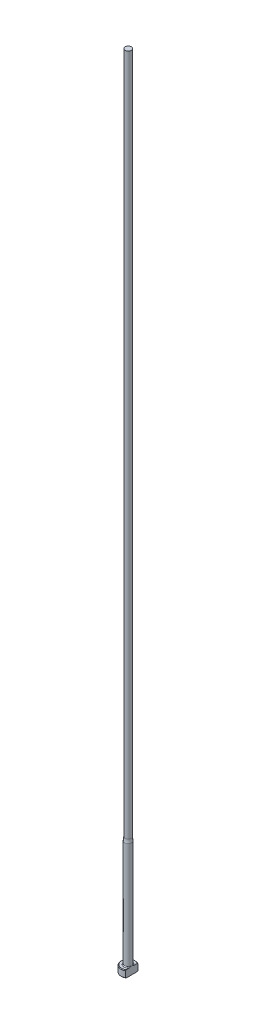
ISO-10303-21;
HEADER;
FILE_DESCRIPTION(('STEP AP214'),'2;1');
FILE_NAME('part.step','',(''),(''),'','','');
FILE_SCHEMA(('AUTOMOTIVE_DESIGN { 1 0 10303 214 1 1 1 1 }'));
ENDSEC;
DATA;
#1=APPLICATION_CONTEXT('core data for automotive mechanical design processes');
#2=APPLICATION_PROTOCOL_DEFINITION('international standard','automotive_design',2000,#1);
#3=PRODUCT_CONTEXT('',#1,'mechanical');
#4=PRODUCT('Part','Part','',(#3));
#5=PRODUCT_RELATED_PRODUCT_CATEGORY('part','',(#4));
#6=PRODUCT_DEFINITION_FORMATION('','',#4);
#7=PRODUCT_DEFINITION_CONTEXT('part definition',#1,'design');
#8=PRODUCT_DEFINITION('design','',#6,#7);
#9=PRODUCT_DEFINITION_SHAPE('','',#8);
#10=(LENGTH_UNIT() NAMED_UNIT(*) SI_UNIT(.MILLI.,.METRE.));
#11=(NAMED_UNIT(*) PLANE_ANGLE_UNIT() SI_UNIT($,.RADIAN.));
#12=(NAMED_UNIT(*) SI_UNIT($,.STERADIAN.) SOLID_ANGLE_UNIT());
#13=UNCERTAINTY_MEASURE_WITH_UNIT(LENGTH_MEASURE(1.E-05),#10,'distance_accuracy_value','');
#14=(GEOMETRIC_REPRESENTATION_CONTEXT(3) GLOBAL_UNCERTAINTY_ASSIGNED_CONTEXT((#13)) GLOBAL_UNIT_ASSIGNED_CONTEXT((#10,
#11,#12)) REPRESENTATION_CONTEXT('',''));
#15=CARTESIAN_POINT('',(0.,0.,0.));
#16=DIRECTION('',(0.,0.,1.));
#17=DIRECTION('',(1.,0.,0.));
#18=AXIS2_PLACEMENT_3D('',#15,#16,#17);
#19=CARTESIAN_POINT('',(-3.17499999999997,3.175,0.));
#20=DIRECTION('',(0.,1.,0.));
#21=DIRECTION('',(0.,0.,1.));
#22=AXIS2_PLACEMENT_3D('',#19,#20,#21);
#23=PLANE('',#22);
#24=CARTESIAN_POINT('',(0.,3.175,0.));
#25=DIRECTION('',(0.,1.,0.));
#26=DIRECTION('',(0.,0.,1.));
#27=AXIS2_PLACEMENT_3D('',#24,#25,#26);
#28=CIRCLE('',#27,2.92099999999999);
#29=CARTESIAN_POINT('',(1.58749999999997,3.175,-2.4519552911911));
#30=VERTEX_POINT('',#29);
#31=CARTESIAN_POINT('',(1.58749999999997,3.175,2.4519552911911));
#32=VERTEX_POINT('',#31);
#33=EDGE_CURVE('E105',#30,#32,#28,.T.);
#34=ORIENTED_EDGE('',*,*,#33,.T.);
#35=DIRECTION('',(0.,0.,1.));
#36=VECTOR('',#35,1.);
#37=CARTESIAN_POINT('',(1.58749999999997,3.17499999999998,2.74963065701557));
#38=LINE('',#37,#36);
#39=CARTESIAN_POINT('',(1.58749999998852,3.175,1.16397422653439));
#40=VERTEX_POINT('',#39);
#41=EDGE_CURVE('E126',#40,#32,#38,.T.);
#42=ORIENTED_EDGE('',*,*,#41,.F.);
#43=CARTESIAN_POINT('',(0.,3.175,0.));
#44=DIRECTION('',(0.,1.,0.));
#45=DIRECTION('',(0.,0.,1.));
#46=AXIS2_PLACEMENT_3D('',#43,#44,#45);
#47=CIRCLE('',#46,1.96849999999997);
#48=CARTESIAN_POINT('',(1.58749999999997,3.175,-1.16397422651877));
#49=VERTEX_POINT('',#48);
#50=EDGE_CURVE('E11',#40,#49,#47,.F.);
#51=ORIENTED_EDGE('',*,*,#50,.T.);
#52=EDGE_CURVE('E52',#30,#49,#38,.T.);
#53=ORIENTED_EDGE('',*,*,#52,.F.);
#54=EDGE_LOOP('',(#34,#42,#51,#53));
#55=FACE_BOUND('',#54,.T.);
#56=ADVANCED_FACE('F32',(#55),#23,.T.);
#57=CARTESIAN_POINT('',(0.,259.958771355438,0.));
#58=DIRECTION('',(0.,1.,0.));
#59=DIRECTION('',(0.,0.,1.));
#60=AXIS2_PLACEMENT_3D('',#57,#58,#59);
#61=CYLINDRICAL_SURFACE('',#60,3.17499999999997);
#62=CARTESIAN_POINT('',(0.,2.92100000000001,0.));
#63=DIRECTION('',(0.,1.,0.));
#64=DIRECTION('',(0.,0.,1.));
#65=AXIS2_PLACEMENT_3D('',#62,#63,#64);
#66=CIRCLE('',#65,3.17499999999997);
#67=CARTESIAN_POINT('',(1.58749999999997,2.92100000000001,2.74963065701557));
#68=VERTEX_POINT('',#67);
#69=CARTESIAN_POINT('',(1.58749999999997,2.92100000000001,-2.74963065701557));
#70=VERTEX_POINT('',#69);
#71=EDGE_CURVE('E98',#68,#70,#66,.F.);
#72=ORIENTED_EDGE('',*,*,#71,.T.);
#73=DIRECTION('',(0.,-1.,0.));
#74=VECTOR('',#73,1.);
#75=CARTESIAN_POINT('',(1.58749999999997,355.601,-2.74963065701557));
#76=LINE('',#75,#74);
#77=CARTESIAN_POINT('',(1.58749999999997,0.253999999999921,-2.74963065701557));
#78=VERTEX_POINT('',#77);
#79=EDGE_CURVE('E141',#70,#78,#76,.T.);
#80=ORIENTED_EDGE('',*,*,#79,.T.);
#81=CARTESIAN_POINT('',(0.,0.253999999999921,0.));
#82=DIRECTION('',(0.,-1.,0.));
#83=DIRECTION('',(0.,0.,-1.));
#84=AXIS2_PLACEMENT_3D('',#81,#82,#83);
#85=CIRCLE('',#84,3.17499999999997);
#86=CARTESIAN_POINT('',(1.58749999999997,0.253999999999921,2.74963065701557));
#87=VERTEX_POINT('',#86);
#88=EDGE_CURVE('E95',#78,#87,#85,.F.);
#89=ORIENTED_EDGE('',*,*,#88,.T.);
#90=DIRECTION('',(0.,-1.,0.));
#91=VECTOR('',#90,1.);
#92=CARTESIAN_POINT('',(1.58749999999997,355.601,2.74963065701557));
#93=LINE('',#92,#91);
#94=EDGE_CURVE('E88',#68,#87,#93,.T.);
#95=ORIENTED_EDGE('',*,*,#94,.F.);
#96=EDGE_LOOP('',(#72,#80,#89,#95));
#97=FACE_BOUND('',#96,.T.);
#98=ADVANCED_FACE('F191',(#97),#61,.T.);
#99=CARTESIAN_POINT('',(0.,0.,0.));
#100=DIRECTION('',(0.,-1.,0.));
#101=DIRECTION('',(0.,0.,-1.));
#102=AXIS2_PLACEMENT_3D('',#99,#100,#101);
#103=PLANE('',#102);
#104=CARTESIAN_POINT('',(0.,0.,0.));
#105=DIRECTION('',(0.,-1.,0.));
#106=DIRECTION('',(0.,0.,-1.));
#107=AXIS2_PLACEMENT_3D('',#104,#105,#106);
#108=CIRCLE('',#107,2.92100000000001);
#109=CARTESIAN_POINT('',(1.58749999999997,0.,2.45195529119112));
#110=VERTEX_POINT('',#109);
#111=CARTESIAN_POINT('',(1.58749999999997,0.,-2.45195529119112));
#112=VERTEX_POINT('',#111);
#113=EDGE_CURVE('E93',#110,#112,#108,.T.);
#114=ORIENTED_EDGE('',*,*,#113,.T.);
#115=DIRECTION('',(0.,0.,1.));
#116=VECTOR('',#115,1.);
#117=CARTESIAN_POINT('',(1.58749999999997,0.,2.74963065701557));
#118=LINE('',#117,#116);
#119=EDGE_CURVE('E78',#112,#110,#118,.T.);
#120=ORIENTED_EDGE('',*,*,#119,.T.);
#121=EDGE_LOOP('',(#114,#120));
#122=FACE_BOUND('',#121,.T.);
#123=ADVANCED_FACE('F97',(#122),#103,.T.);
#124=CARTESIAN_POINT('',(0.,3.17499999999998,0.));
#125=DIRECTION('',(0.,-1.,0.));
#126=DIRECTION('',(0.,0.,-1.));
#127=AXIS2_PLACEMENT_3D('',#124,#125,#126);
#128=CONICAL_SURFACE('',#127,2.92100000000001,0.785398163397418);
#129=ORIENTED_EDGE('',*,*,#71,.F.);
#130=CARTESIAN_POINT('',(1.58749999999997,-0.161620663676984,-6.0529050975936));
#131=CARTESIAN_POINT('',(1.58749999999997,-0.0288893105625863,-5.91567682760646));
#132=CARTESIAN_POINT('',(1.58749999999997,0.103699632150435,-5.77831035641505));
#133=CARTESIAN_POINT('',(1.58749999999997,0.368508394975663,-5.50321874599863));
#134=CARTESIAN_POINT('',(1.58749999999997,0.5007282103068,-5.3654936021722));
#135=CARTESIAN_POINT('',(1.58749999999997,0.764778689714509,-5.08953516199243));
#136=CARTESIAN_POINT('',(1.58749999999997,0.896609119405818,-4.95130164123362));
#137=CARTESIAN_POINT('',(1.58749999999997,1.15968706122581,-4.67428233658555));
#138=CARTESIAN_POINT('',(1.58749999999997,1.29093457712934,-4.5354965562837));
#139=CARTESIAN_POINT('',(1.58749999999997,1.55007705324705,-4.25997724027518));
#140=CARTESIAN_POINT('',(1.58749999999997,1.67798684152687,-4.12325766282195));
#141=CARTESIAN_POINT('',(1.58749999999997,1.9328486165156,-3.84892898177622));
#142=CARTESIAN_POINT('',(1.58749999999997,2.05980060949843,-3.71131988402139));
#143=CARTESIAN_POINT('',(1.58749999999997,2.31237508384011,-3.43493978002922));
#144=CARTESIAN_POINT('',(1.58749999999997,2.43799784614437,-3.29616903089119));
#145=CARTESIAN_POINT('',(1.58749999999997,2.68741369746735,-3.01699558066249));
#146=CARTESIAN_POINT('',(1.58749999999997,2.81120686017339,-2.8765929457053));
#147=CARTESIAN_POINT('',(1.58749999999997,3.00875865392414,-2.64816703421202));
#148=CARTESIAN_POINT('',(1.58749999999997,3.08336151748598,-2.56087478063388));
#149=CARTESIAN_POINT('',(1.58749999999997,3.23123871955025,-2.385154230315));
#150=CARTESIAN_POINT('',(1.58749999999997,3.30451292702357,-2.29672582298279));
#151=CARTESIAN_POINT('',(1.58749999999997,3.45004422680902,-2.11747400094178));
#152=CARTESIAN_POINT('',(1.58749999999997,3.52228237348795,-2.02663514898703));
#153=CARTESIAN_POINT('',(1.58749999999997,3.66423097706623,-1.84302524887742));
#154=CARTESIAN_POINT('',(1.58749999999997,3.73394203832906,-1.75025467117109));
#155=CARTESIAN_POINT('',(1.58749999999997,3.87080633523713,-1.56067475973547));
#156=CARTESIAN_POINT('',(1.58749999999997,3.93790459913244,-1.46382547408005));
#157=CARTESIAN_POINT('',(1.58749999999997,4.06669147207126,-1.26632594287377));
#158=CARTESIAN_POINT('',(1.58749999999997,4.12837264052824,-1.16567073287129));
#159=CARTESIAN_POINT('',(1.58749999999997,4.21402252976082,-1.01165766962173));
#160=CARTESIAN_POINT('',(1.58749999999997,4.2412792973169,-0.960142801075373));
#161=CARTESIAN_POINT('',(1.58749999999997,4.29309798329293,-0.85578092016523));
#162=CARTESIAN_POINT('',(1.58749999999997,4.3176594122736,-0.802933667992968));
#163=CARTESIAN_POINT('',(1.58749999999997,4.38614656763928,-0.642461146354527));
#164=CARTESIAN_POINT('',(1.58749999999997,4.42510149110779,-0.532518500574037));
#165=CARTESIAN_POINT('',(1.58749999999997,4.46726244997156,-0.367680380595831));
#166=CARTESIAN_POINT('',(1.58749999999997,4.47844427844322,-0.314802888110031));
#167=CARTESIAN_POINT('',(1.58749999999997,4.49576654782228,-0.208209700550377));
#168=CARTESIAN_POINT('',(1.58749999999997,4.50190743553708,-0.154494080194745));
#169=CARTESIAN_POINT('',(1.58749999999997,4.50871296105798,-0.0468792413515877));
#170=CARTESIAN_POINT('',(1.58749999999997,4.50939451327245,0.00701889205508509));
#171=CARTESIAN_POINT('',(1.58749999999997,4.5052767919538,0.114606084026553));
#172=CARTESIAN_POINT('',(1.58749999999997,4.5004770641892,0.16829512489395));
#173=CARTESIAN_POINT('',(1.58749999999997,4.48579689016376,0.274485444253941));
#174=CARTESIAN_POINT('',(1.58749999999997,4.47596081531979,0.326992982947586));
#175=CARTESIAN_POINT('',(1.58749999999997,4.4518180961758,0.430974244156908));
#176=CARTESIAN_POINT('',(1.58749999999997,4.43750969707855,0.482447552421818));
#177=CARTESIAN_POINT('',(1.58749999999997,4.40502489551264,0.58446088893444));
#178=CARTESIAN_POINT('',(1.58749999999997,4.38682724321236,0.634994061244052));
#179=CARTESIAN_POINT('',(1.58749999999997,4.34729308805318,0.734789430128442));
#180=CARTESIAN_POINT('',(1.58749999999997,4.32595722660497,0.784051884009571));
#181=CARTESIAN_POINT('',(1.58749999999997,4.25791922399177,0.93054934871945));
#182=CARTESIAN_POINT('',(1.58749999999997,4.20736047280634,1.02598802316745));
#183=CARTESIAN_POINT('',(1.58749999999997,4.09955451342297,1.21304313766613));
#184=CARTESIAN_POINT('',(1.58749999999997,4.04229912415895,1.30465471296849));
#185=CARTESIAN_POINT('',(1.58749999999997,3.92308746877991,1.48526211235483));
#186=CARTESIAN_POINT('',(1.58749999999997,3.86111349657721,1.57424615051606));
#187=CARTESIAN_POINT('',(1.58749999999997,3.73408621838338,1.74990003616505));
#188=CARTESIAN_POINT('',(1.58749999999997,3.66903444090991,1.83657099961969));
#189=CARTESIAN_POINT('',(1.58749999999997,3.53583371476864,2.009317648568));
#190=CARTESIAN_POINT('',(1.58749999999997,3.46765527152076,2.09537048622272));
#191=CARTESIAN_POINT('',(1.58749999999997,3.32960643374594,2.26611736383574));
#192=CARTESIAN_POINT('',(1.58749999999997,3.25973586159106,2.35081125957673));
#193=CARTESIAN_POINT('',(1.58749999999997,3.04858139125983,2.60290121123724));
#194=CARTESIAN_POINT('',(1.58749999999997,2.90542388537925,2.7687253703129));
#195=CARTESIAN_POINT('',(1.58749999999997,2.64069522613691,3.06970913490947));
#196=CARTESIAN_POINT('',(1.58749999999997,2.5195945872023,3.20528660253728));
#197=CARTESIAN_POINT('',(1.58749999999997,2.27590400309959,3.47510321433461));
#198=CARTESIAN_POINT('',(1.58749999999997,2.1533140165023,3.60934232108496));
#199=CARTESIAN_POINT('',(1.58749999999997,1.9069423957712,3.87695374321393));
#200=CARTESIAN_POINT('',(1.58749999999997,1.78315974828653,4.01032512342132));
#201=CARTESIAN_POINT('',(1.58749999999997,1.53478104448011,4.2763088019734));
#202=CARTESIAN_POINT('',(1.58749999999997,1.41018498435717,4.40892109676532));
#203=CARTESIAN_POINT('',(1.58749999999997,1.04574684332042,4.79499418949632));
#204=CARTESIAN_POINT('',(1.58749999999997,0.805076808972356,5.04767313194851));
#205=CARTESIAN_POINT('',(1.58749999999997,0.44312150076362,5.42550911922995));
#206=CARTESIAN_POINT('',(1.58749999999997,0.322378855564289,5.55118772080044));
#207=CARTESIAN_POINT('',(1.58749999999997,0.0805914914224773,5.8022520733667));
#208=CARTESIAN_POINT('',(1.58749999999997,-0.0404532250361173,5.92763782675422));
#209=CARTESIAN_POINT('',(1.58749999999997,-0.161620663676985,6.0529050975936));
#210=B_SPLINE_CURVE_WITH_KNOTS('',3,(#130,#131,#132,#133,#134,#135,#136,#137,#138,#139,#140,
#141,#142,#143,#144,#145,#146,#147,#148,#149,#150,#151,#152,#153,#154,#155,#156,#157,#158,#159,
#160,#161,#162,#163,#164,#165,#166,#167,#168,#169,#170,#171,#172,#173,#174,#175,#176,#177,#178,
#179,#180,#181,#182,#183,#184,#185,#186,#187,#188,#189,#190,#191,#192,#193,#194,#195,#196,#197,
#198,#199,#200,#201,#202,#203,#204,#205,#206,#207,#208,#209),.UNSPECIFIED.,.F.,.F.,(4,2,2,2,2,2,
2,2,2,2,2,2,2,2,2,2,2,2,2,2,2,2,2,2,2,2,2,2,2,2,2,2,2,2,2,2,2,2,2,4),(0.,0.572750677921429,
1.14550874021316,1.71856057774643,2.29160869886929,2.85328006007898,3.41494773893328,
3.97649423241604,4.53801804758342,4.88249307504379,5.2270018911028,5.57515326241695,
5.92322081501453,6.27657800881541,6.63041319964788,6.80518126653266,6.97998101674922,
7.32824262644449,7.49018491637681,7.65211285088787,7.81353889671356,7.97497832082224,
8.13501929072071,8.29512313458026,8.45612518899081,8.61709438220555,8.94062993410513,
9.26456495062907,9.58978187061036,9.91483894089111,10.2441741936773,10.5735441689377,
11.2306812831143,11.7760337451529,12.3214014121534,12.8672825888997,13.4131663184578,
14.4600164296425,14.9828595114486,15.505698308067),.UNSPECIFIED.);
#211=EDGE_CURVE('E118',#32,#68,#210,.T.);
#212=ORIENTED_EDGE('',*,*,#211,.F.);
#213=ORIENTED_EDGE('',*,*,#33,.F.);
#214=EDGE_CURVE('E117',#70,#30,#210,.T.);
#215=ORIENTED_EDGE('',*,*,#214,.F.);
#216=EDGE_LOOP('',(#129,#212,#213,#215));
#217=FACE_BOUND('',#216,.T.);
#218=ADVANCED_FACE('F162',(#217),#128,.T.);
#219=CARTESIAN_POINT('',(0.,0.253999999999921,0.));
#220=DIRECTION('',(0.,1.,0.));
#221=DIRECTION('',(0.,0.,1.));
#222=AXIS2_PLACEMENT_3D('',#219,#220,#221);
#223=CONICAL_SURFACE('',#222,3.17499999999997,0.785398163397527);
#224=ORIENTED_EDGE('',*,*,#88,.F.);
#225=CARTESIAN_POINT('',(1.58749999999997,3.33662066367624,6.0529050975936));
#226=CARTESIAN_POINT('',(1.58749999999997,3.20388931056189,5.91567682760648));
#227=CARTESIAN_POINT('',(1.58749999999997,3.07130036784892,5.7783103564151));
#228=CARTESIAN_POINT('',(1.58749999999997,2.80649160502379,5.50321874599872));
#229=CARTESIAN_POINT('',(1.58749999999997,2.6742717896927,5.36549360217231));
#230=CARTESIAN_POINT('',(1.58749999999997,2.41022131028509,5.08953516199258));
#231=CARTESIAN_POINT('',(1.58749999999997,2.27839088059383,4.95130164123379));
#232=CARTESIAN_POINT('',(1.58749999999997,2.01531293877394,4.67428233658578));
#233=CARTESIAN_POINT('',(1.58749999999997,1.88406542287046,4.53549655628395));
#234=CARTESIAN_POINT('',(1.58749999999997,1.62492294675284,4.25997724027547));
#235=CARTESIAN_POINT('',(1.58749999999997,1.49701315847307,4.12325766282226));
#236=CARTESIAN_POINT('',(1.58749999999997,1.24215138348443,3.84892898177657));
#237=CARTESIAN_POINT('',(1.58749999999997,1.11519939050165,3.71131988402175));
#238=CARTESIAN_POINT('',(1.58749999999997,0.862624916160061,3.43493978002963));
#239=CARTESIAN_POINT('',(1.58749999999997,0.737002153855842,3.29616903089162));
#240=CARTESIAN_POINT('',(1.58749999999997,0.487586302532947,3.01699558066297));
#241=CARTESIAN_POINT('',(1.58749999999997,0.363793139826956,2.8765929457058));
#242=CARTESIAN_POINT('',(1.58749999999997,0.166241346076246,2.64816703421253));
#243=CARTESIAN_POINT('',(1.58749999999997,0.0916384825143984,2.56087478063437));
#244=CARTESIAN_POINT('',(1.58749999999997,-0.0562387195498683,2.38515423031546));
#245=CARTESIAN_POINT('',(1.58749999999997,-0.129512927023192,2.29672582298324));
#246=CARTESIAN_POINT('',(1.58749999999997,-0.275044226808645,2.1174740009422));
#247=CARTESIAN_POINT('',(1.58749999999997,-0.347282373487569,2.02663514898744));
#248=CARTESIAN_POINT('',(1.58749999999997,-0.489230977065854,1.8430252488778));
#249=CARTESIAN_POINT('',(1.58749999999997,-0.558942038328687,1.75025467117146));
#250=CARTESIAN_POINT('',(1.58749999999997,-0.695806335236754,1.5606747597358));
#251=CARTESIAN_POINT('',(1.58749999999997,-0.762904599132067,1.46382547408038));
#252=CARTESIAN_POINT('',(1.58749999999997,-0.89169147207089,1.26632594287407));
#253=CARTESIAN_POINT('',(1.58749999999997,-0.953372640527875,1.16567073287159));
#254=CARTESIAN_POINT('',(1.58749999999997,-1.03902252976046,1.01165766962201));
#255=CARTESIAN_POINT('',(1.58749999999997,-1.06627929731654,0.960142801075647));
#256=CARTESIAN_POINT('',(1.58749999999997,-1.11809798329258,0.855780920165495));
#257=CARTESIAN_POINT('',(1.58749999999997,-1.14265941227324,0.802933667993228));
#258=CARTESIAN_POINT('',(1.58749999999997,-1.21114656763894,0.642461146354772));
#259=CARTESIAN_POINT('',(1.58749999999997,-1.25010149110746,0.532518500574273));
#260=CARTESIAN_POINT('',(1.58749999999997,-1.29226244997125,0.367680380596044));
#261=CARTESIAN_POINT('',(1.58749999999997,-1.30344427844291,0.314802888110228));
#262=CARTESIAN_POINT('',(1.58749999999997,-1.32076654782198,0.208209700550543));
#263=CARTESIAN_POINT('',(1.58749999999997,-1.32690743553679,0.154494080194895));
#264=CARTESIAN_POINT('',(1.58749999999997,-1.3337129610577,0.0468792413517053));
#265=CARTESIAN_POINT('',(1.58749999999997,-1.33439451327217,-0.00701889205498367));
#266=CARTESIAN_POINT('',(1.58749999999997,-1.33027679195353,-0.114606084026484));
#267=CARTESIAN_POINT('',(1.58749999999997,-1.32547706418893,-0.168295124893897));
#268=CARTESIAN_POINT('',(1.58749999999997,-1.31079689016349,-0.274485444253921));
#269=CARTESIAN_POINT('',(1.58749999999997,-1.30096081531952,-0.326992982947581));
#270=CARTESIAN_POINT('',(1.58749999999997,-1.27681809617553,-0.430974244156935));
#271=CARTESIAN_POINT('',(1.58749999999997,-1.26250969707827,-0.48244755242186));
#272=CARTESIAN_POINT('',(1.58749999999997,-1.23002489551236,-0.584460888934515));
#273=CARTESIAN_POINT('',(1.58749999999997,-1.21182724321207,-0.634994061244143));
#274=CARTESIAN_POINT('',(1.58749999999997,-1.17229308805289,-0.734789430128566));
#275=CARTESIAN_POINT('',(1.58749999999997,-1.15095722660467,-0.784051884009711));
#276=CARTESIAN_POINT('',(1.58749999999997,-1.08291922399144,-0.930549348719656));
#277=CARTESIAN_POINT('',(1.58749999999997,-1.03236047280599,-1.0259880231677));
#278=CARTESIAN_POINT('',(1.58749999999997,-0.924554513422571,-1.21304313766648));
#279=CARTESIAN_POINT('',(1.58749999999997,-0.867299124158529,-1.30465471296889));
#280=CARTESIAN_POINT('',(1.58749999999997,-0.748087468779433,-1.48526211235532));
#281=CARTESIAN_POINT('',(1.58749999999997,-0.686113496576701,-1.5742461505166));
#282=CARTESIAN_POINT('',(1.58749999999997,-0.559086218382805,-1.74990003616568));
#283=CARTESIAN_POINT('',(1.58749999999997,-0.494034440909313,-1.83657099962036));
#284=CARTESIAN_POINT('',(1.58749999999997,-0.360833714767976,-2.00931764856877));
#285=CARTESIAN_POINT('',(1.58749999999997,-0.292655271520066,-2.09537048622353));
#286=CARTESIAN_POINT('',(1.58749999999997,-0.154606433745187,-2.26611736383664));
#287=CARTESIAN_POINT('',(1.58749999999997,-0.0847358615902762,-2.35081125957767));
#288=CARTESIAN_POINT('',(1.58749999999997,0.126418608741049,-2.60290121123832));
#289=CARTESIAN_POINT('',(1.58749999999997,0.269576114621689,-2.76872537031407));
#290=CARTESIAN_POINT('',(1.58749999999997,0.534304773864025,-3.06970913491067));
#291=CARTESIAN_POINT('',(1.58749999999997,0.655405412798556,-3.20528660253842));
#292=CARTESIAN_POINT('',(1.58749999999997,0.899095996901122,-3.47510321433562));
#293=CARTESIAN_POINT('',(1.58749999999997,1.02168598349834,-3.60934232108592));
#294=CARTESIAN_POINT('',(1.58749999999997,1.26805760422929,-3.87695374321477));
#295=CARTESIAN_POINT('',(1.58749999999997,1.39184025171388,-4.0103251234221));
#296=CARTESIAN_POINT('',(1.58749999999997,1.64021895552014,-4.27630880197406));
#297=CARTESIAN_POINT('',(1.58749999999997,1.76481501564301,-4.40892109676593));
#298=CARTESIAN_POINT('',(1.58749999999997,2.12925315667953,-4.79499418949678));
#299=CARTESIAN_POINT('',(1.58749999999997,2.36992319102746,-5.04767313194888));
#300=CARTESIAN_POINT('',(1.58749999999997,2.73187849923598,-5.42550911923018));
#301=CARTESIAN_POINT('',(1.58749999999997,2.85262114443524,-5.55118772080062));
#302=CARTESIAN_POINT('',(1.58749999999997,3.09440850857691,-5.80225207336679));
#303=CARTESIAN_POINT('',(1.58749999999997,3.21545322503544,-5.92763782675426));
#304=CARTESIAN_POINT('',(1.58749999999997,3.33662066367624,-6.0529050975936));
#305=B_SPLINE_CURVE_WITH_KNOTS('',3,(#225,#226,#227,#228,#229,#230,#231,#232,#233,#234,#235,
#236,#237,#238,#239,#240,#241,#242,#243,#244,#245,#246,#247,#248,#249,#250,#251,#252,#253,#254,
#255,#256,#257,#258,#259,#260,#261,#262,#263,#264,#265,#266,#267,#268,#269,#270,#271,#272,#273,
#274,#275,#276,#277,#278,#279,#280,#281,#282,#283,#284,#285,#286,#287,#288,#289,#290,#291,#292,
#293,#294,#295,#296,#297,#298,#299,#300,#301,#302,#303,#304),.UNSPECIFIED.,.F.,.F.,(4,2,2,2,2,2,
2,2,2,2,2,2,2,2,2,2,2,2,2,2,2,2,2,2,2,2,2,2,2,2,2,2,2,2,2,2,2,2,2,4),(0.,0.572750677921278,
1.14550874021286,1.71856057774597,2.29160869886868,2.85328006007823,3.4149477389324,
3.97649423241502,4.53801804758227,4.88249307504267,5.22700189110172,5.5751532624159,
5.92322081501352,6.27657800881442,6.63041319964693,6.80518126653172,6.9799810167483,
7.3282426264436,7.49018491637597,7.65211285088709,7.81353889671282,7.97497832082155,
8.13501929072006,8.29512313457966,8.45612518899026,8.61709438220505,8.9406299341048,
9.2645649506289,9.58978187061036,9.91483894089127,10.2441741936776,10.5735441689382,
11.2306812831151,11.7760337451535,12.3214014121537,12.8672825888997,13.4131663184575,
14.4600164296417,14.9828595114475,15.5056983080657),.UNSPECIFIED.);
#306=EDGE_CURVE('E81',#112,#78,#305,.T.);
#307=ORIENTED_EDGE('',*,*,#306,.F.);
#308=ORIENTED_EDGE('',*,*,#113,.F.);
#309=EDGE_CURVE('E84',#87,#110,#305,.T.);
#310=ORIENTED_EDGE('',*,*,#309,.F.);
#311=EDGE_LOOP('',(#224,#307,#308,#310));
#312=FACE_BOUND('',#311,.T.);
#313=ADVANCED_FACE('F92',(#312),#223,.T.);
#314=CARTESIAN_POINT('',(0.,3.556,0.));
#315=DIRECTION('',(0.,1.,0.));
#316=DIRECTION('',(0.,0.,1.));
#317=AXIS2_PLACEMENT_3D('',#314,#315,#316);
#318=TOROIDAL_SURFACE('',#317,1.96849999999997,0.381);
#319=CARTESIAN_POINT('',(1.58749999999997,3.556,0.));
#320=CARTESIAN_POINT('',(1.58749999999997,3.55599928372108,-9.72839998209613E-12));
#321=CARTESIAN_POINT('',(1.58749999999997,3.55599856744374,-1.16390048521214E-07));
#322=CARTESIAN_POINT('',(1.58749999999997,3.55599717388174,-5.02802253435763E-07));
#323=CARTESIAN_POINT('',(1.58749999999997,3.55599649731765,-7.75049116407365E-07));
#324=CARTESIAN_POINT('',(1.58749999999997,3.55599515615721,-1.43578185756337E-06));
#325=CARTESIAN_POINT('',(1.58749999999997,3.55599449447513,-1.83004116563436E-06));
#326=CARTESIAN_POINT('',(1.58749999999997,3.55599322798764,-2.69326525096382E-06));
#327=CARTESIAN_POINT('',(1.58749999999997,3.55599262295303,-3.16190628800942E-06));
#328=CARTESIAN_POINT('',(1.58749999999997,3.55599066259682,-4.80183833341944E-06));
#329=CARTESIAN_POINT('',(1.58749999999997,3.55598938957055,-6.07237548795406E-06));
#330=CARTESIAN_POINT('',(1.58749999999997,3.55598706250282,-8.74131694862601E-06));
#331=CARTESIAN_POINT('',(1.58749999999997,3.55598600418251,-1.01362054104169E-05));
#332=CARTESIAN_POINT('',(1.58749999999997,3.55598220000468,-1.54025644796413E-05));
#333=CARTESIAN_POINT('',(1.58749999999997,3.55597966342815,-1.94297992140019E-05));
#334=CARTESIAN_POINT('',(1.58749999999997,3.55597535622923,-2.75116574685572E-05));
#335=CARTESIAN_POINT('',(1.58749999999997,3.55597354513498,-3.15456374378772E-05));
#336=CARTESIAN_POINT('',(1.58749999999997,3.55596616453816,-4.82039076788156E-05));
#337=CARTESIAN_POINT('',(1.58749999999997,3.55596077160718,-6.08993138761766E-05));
#338=CARTESIAN_POINT('',(1.58749999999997,3.55595181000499,-8.49758225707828E-05));
#339=CARTESIAN_POINT('',(1.58749999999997,3.55594809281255,-9.6299831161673E-05));
#340=CARTESIAN_POINT('',(1.58749999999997,3.55591954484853,-0.000176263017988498));
#341=CARTESIAN_POINT('',(1.58749999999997,3.55588430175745,-0.000240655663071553));
#342=CARTESIAN_POINT('',(1.58749999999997,3.55575419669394,-0.000487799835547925));
#343=CARTESIAN_POINT('',(1.58749999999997,3.55566706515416,-0.000673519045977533));
#344=CARTESIAN_POINT('',(1.58749999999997,3.55532896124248,-0.00138308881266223));
#345=CARTESIAN_POINT('',(1.58749999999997,3.55506990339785,-0.0019038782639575));
#346=CARTESIAN_POINT('',(1.58749999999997,3.55403272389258,-0.00399959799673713));
#347=CARTESIAN_POINT('',(1.58749999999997,3.55326363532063,-0.0055779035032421));
#348=CARTESIAN_POINT('',(1.58749999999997,3.53734419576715,-0.0382341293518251));
#349=CARTESIAN_POINT('',(1.58749999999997,3.52209124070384,-0.0692744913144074));
#350=CARTESIAN_POINT('',(1.58749999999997,3.49234031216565,-0.130397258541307));
#351=CARTESIAN_POINT('',(1.58749999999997,3.4778343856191,-0.160476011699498));
#352=CARTESIAN_POINT('',(1.58749999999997,3.44756579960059,-0.22405302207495));
#353=CARTESIAN_POINT('',(1.58749999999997,3.43183768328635,-0.257567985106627));
#354=CARTESIAN_POINT('',(1.58749999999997,3.40084315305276,-0.325196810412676));
#355=CARTESIAN_POINT('',(1.58749999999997,3.38558252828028,-0.359313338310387));
#356=CARTESIAN_POINT('',(1.58749999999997,3.35947844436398,-0.419670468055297));
#357=CARTESIAN_POINT('',(1.58749999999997,3.34845502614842,-0.445832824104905));
#358=CARTESIAN_POINT('',(1.58749999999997,3.32703860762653,-0.498343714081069));
#359=CARTESIAN_POINT('',(1.58749999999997,3.31664422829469,-0.52469168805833));
#360=CARTESIAN_POINT('',(1.58749999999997,3.2869407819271,-0.603098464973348));
#361=CARTESIAN_POINT('',(1.58749999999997,3.26865317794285,-0.655557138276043));
#362=CARTESIAN_POINT('',(1.58749999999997,3.24332469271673,-0.737608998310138));
#363=CARTESIAN_POINT('',(1.58749999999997,3.23494346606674,-0.766787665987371));
#364=CARTESIAN_POINT('',(1.58749999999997,3.21949479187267,-0.825628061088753));
#365=CARTESIAN_POINT('',(1.58749999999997,3.21243348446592,-0.855291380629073));
#366=CARTESIAN_POINT('',(1.58749999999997,3.19303275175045,-0.947623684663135));
#367=CARTESIAN_POINT('',(1.58749999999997,3.18336484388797,-1.01091582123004));
#368=CARTESIAN_POINT('',(1.58749999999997,3.17464826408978,-1.12491727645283));
#369=CARTESIAN_POINT('',(1.58749999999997,3.17379742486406,-1.17548103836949));
#370=CARTESIAN_POINT('',(1.58749999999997,3.17980825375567,-1.2756075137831));
#371=CARTESIAN_POINT('',(1.58749999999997,3.18656467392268,-1.32517446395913));
#372=CARTESIAN_POINT('',(1.58749999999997,3.20510062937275,-1.40268723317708));
#373=CARTESIAN_POINT('',(1.58749999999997,3.21379930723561,-1.43136704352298));
#374=CARTESIAN_POINT('',(1.58749999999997,3.23523847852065,-1.48727388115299));
#375=CARTESIAN_POINT('',(1.58749999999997,3.24798385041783,-1.51449910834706));
#376=CARTESIAN_POINT('',(1.58749999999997,3.27479889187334,-1.56082978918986));
#377=CARTESIAN_POINT('',(1.58749999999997,3.2880084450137,-1.5804296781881));
#378=CARTESIAN_POINT('',(1.58749999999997,3.31738741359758,-1.61726850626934));
#379=CARTESIAN_POINT('',(1.58749999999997,3.33355126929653,-1.63451177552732));
#380=CARTESIAN_POINT('',(1.58749999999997,3.3650209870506,-1.66235366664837));
#381=CARTESIAN_POINT('',(1.58749999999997,3.37976591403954,-1.67358404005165));
#382=CARTESIAN_POINT('',(1.58749999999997,3.41090649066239,-1.69348690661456));
#383=CARTESIAN_POINT('',(1.58749999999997,3.42730148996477,-1.70216040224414));
#384=CARTESIAN_POINT('',(1.58749999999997,3.46152587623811,-1.71647536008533));
#385=CARTESIAN_POINT('',(1.58749999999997,3.47936500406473,-1.72209384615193));
#386=CARTESIAN_POINT('',(1.58749999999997,3.51579449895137,-1.72977101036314));
#387=CARTESIAN_POINT('',(1.58749999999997,3.53438431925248,-1.73183223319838));
#388=CARTESIAN_POINT('',(1.58749999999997,3.5693049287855,-1.73220894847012));
#389=CARTESIAN_POINT('',(1.58749999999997,3.58563247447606,-1.73095378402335));
#390=CARTESIAN_POINT('',(1.58749999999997,3.61782719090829,-1.72566824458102));
#391=CARTESIAN_POINT('',(1.58749999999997,3.6336944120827,-1.72163817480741));
#392=CARTESIAN_POINT('',(1.58749999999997,3.66430913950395,-1.71112762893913));
#393=CARTESIAN_POINT('',(1.58749999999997,3.67907021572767,-1.70468621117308));
#394=CARTESIAN_POINT('',(1.58749999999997,3.7074589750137,-1.68967506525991));
#395=CARTESIAN_POINT('',(1.58749999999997,3.72108625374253,-1.68110458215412));
#396=CARTESIAN_POINT('',(1.58749999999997,3.75190835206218,-1.6586320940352));
#397=CARTESIAN_POINT('',(1.58749999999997,3.76852524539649,-1.64393589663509));
#398=CARTESIAN_POINT('',(1.58749999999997,3.79915076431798,-1.61203006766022));
#399=CARTESIAN_POINT('',(1.58749999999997,3.81315342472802,-1.59481484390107));
#400=CARTESIAN_POINT('',(1.58749999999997,3.84335302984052,-1.55180967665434));
#401=CARTESIAN_POINT('',(1.58749999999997,3.85840997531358,-1.52522183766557));
#402=CARTESIAN_POINT('',(1.58749999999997,3.8840928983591,-1.47008223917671));
#403=CARTESIAN_POINT('',(1.58749999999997,3.89472145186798,-1.44153163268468));
#404=CARTESIAN_POINT('',(1.58749999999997,3.91656912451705,-1.36850699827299));
#405=CARTESIAN_POINT('',(1.58749999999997,3.92534811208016,-1.32330828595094));
#406=CARTESIAN_POINT('',(1.58749999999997,3.93598980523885,-1.23163561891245));
#407=CARTESIAN_POINT('',(1.58749999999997,3.93776012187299,-1.18515271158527));
#408=CARTESIAN_POINT('',(1.58749999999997,3.93485724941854,-1.056626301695));
#409=CARTESIAN_POINT('',(1.58749999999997,3.9241811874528,-0.974728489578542));
#410=CARTESIAN_POINT('',(1.58749999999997,3.899893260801,-0.855941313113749));
#411=CARTESIAN_POINT('',(1.58749999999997,3.89075037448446,-0.817952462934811));
#412=CARTESIAN_POINT('',(1.58749999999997,3.87034922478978,-0.742758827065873));
#413=CARTESIAN_POINT('',(1.58749999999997,3.85910312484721,-0.705550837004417));
#414=CARTESIAN_POINT('',(1.58749999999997,3.83067738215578,-0.618900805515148));
#415=CARTESIAN_POINT('',(1.58749999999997,3.81279292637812,-0.56969368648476));
#416=CARTESIAN_POINT('',(1.58749999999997,3.78404415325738,-0.496059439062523));
#417=CARTESIAN_POINT('',(1.58749999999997,3.77402894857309,-0.471293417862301));
#418=CARTESIAN_POINT('',(1.58749999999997,3.75347166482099,-0.421913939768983));
#419=CARTESIAN_POINT('',(1.58749999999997,3.74292842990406,-0.39730096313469));
#420=CARTESIAN_POINT('',(1.58749999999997,3.71797467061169,-0.340371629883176));
#421=CARTESIAN_POINT('',(1.58749999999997,3.7034106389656,-0.308122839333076));
#422=CARTESIAN_POINT('',(1.58749999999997,3.67389634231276,-0.244169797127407));
#423=CARTESIAN_POINT('',(1.58749999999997,3.65895097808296,-0.212463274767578));
#424=CARTESIAN_POINT('',(1.58749999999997,3.63022587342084,-0.152300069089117));
#425=CARTESIAN_POINT('',(1.58749999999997,3.61647532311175,-0.123829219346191));
#426=CARTESIAN_POINT('',(1.58749999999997,3.58829058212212,-0.065967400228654));
#427=CARTESIAN_POINT('',(1.58749999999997,3.57384944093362,-0.036579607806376));
#428=CARTESIAN_POINT('',(1.58749999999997,3.55873641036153,-0.00557801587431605));
#429=CARTESIAN_POINT('',(1.58749999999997,3.557967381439,-0.00399981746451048));
#430=CARTESIAN_POINT('',(1.58749999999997,3.55693021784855,-0.00190412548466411));
#431=CARTESIAN_POINT('',(1.58749999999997,3.55667111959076,-0.00138325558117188));
#432=CARTESIAN_POINT('',(1.58749999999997,3.55633296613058,-0.00067358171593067));
#433=CARTESIAN_POINT('',(1.58749999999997,3.55624582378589,-0.000487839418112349));
#434=CARTESIAN_POINT('',(1.58749999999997,3.55611570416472,-0.000240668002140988));
#435=CARTESIAN_POINT('',(1.58749999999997,3.55608045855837,-0.000176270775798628));
#436=CARTESIAN_POINT('',(1.58749999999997,3.55605190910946,-9.63021903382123E-05));
#437=CARTESIAN_POINT('',(1.58749999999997,3.55604819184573,-8.49777827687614E-05));
#438=CARTESIAN_POINT('',(1.58749999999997,3.55603922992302,-6.09004217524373E-05));
#439=CARTESIAN_POINT('',(1.58749999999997,3.55603383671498,-4.82045726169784E-05));
#440=CARTESIAN_POINT('',(1.58749999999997,3.55602645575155,-3.15458034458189E-05));
#441=CARTESIAN_POINT('',(1.58749999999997,3.55602464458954,-2.75117552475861E-05));
#442=CARTESIAN_POINT('',(1.58749999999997,3.55602033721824,-1.94297725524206E-05));
#443=CARTESIAN_POINT('',(1.58749999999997,3.55601780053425,-1.54024835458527E-05));
#444=CARTESIAN_POINT('',(1.58749999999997,3.55601399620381,-1.01360754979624E-05));
#445=CARTESIAN_POINT('',(1.58749999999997,3.55601293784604,-8.7411813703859E-06));
#446=CARTESIAN_POINT('',(1.58749999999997,3.55601061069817,-6.07223627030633E-06));
#447=CARTESIAN_POINT('',(1.58749999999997,3.55600933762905,-4.80170138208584E-06));
#448=CARTESIAN_POINT('',(1.58749999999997,3.55600737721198,-3.16178168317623E-06));
#449=CARTESIAN_POINT('',(1.58749999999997,3.55600677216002,-2.69314602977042E-06));
#450=CARTESIAN_POINT('',(1.58749999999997,3.55600550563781,-1.82993577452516E-06));
#451=CARTESIAN_POINT('',(1.58749999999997,3.55600484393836,-1.43568493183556E-06));
#452=CARTESIAN_POINT('',(1.58749999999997,3.55600350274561,-7.74972790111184E-07));
#453=CARTESIAN_POINT('',(1.58749999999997,3.55600282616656,-5.02737772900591E-07));
#454=CARTESIAN_POINT('',(1.58749999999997,3.55600143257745,-1.16354060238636E-07));
#455=CARTESIAN_POINT('',(1.58749999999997,3.55600071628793,9.72852226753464E-12));
#456=CARTESIAN_POINT('',(1.58749999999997,3.556,0.));
#457=B_SPLINE_CURVE_WITH_KNOTS('',3,(#319,#320,#321,#322,#323,#324,#325,#326,#327,#328,#329,
#330,#331,#332,#333,#334,#335,#336,#337,#338,#339,#340,#341,#342,#343,#344,#345,#346,#347,#348,
#349,#350,#351,#352,#353,#354,#355,#356,#357,#358,#359,#360,#361,#362,#363,#364,#365,#366,#367,
#368,#369,#370,#371,#372,#373,#374,#375,#376,#377,#378,#379,#380,#381,#382,#383,#384,#385,#386,
#387,#388,#389,#390,#391,#392,#393,#394,#395,#396,#397,#398,#399,#400,#401,#402,#403,#404,#405,
#406,#407,#408,#409,#410,#411,#412,#413,#414,#415,#416,#417,#418,#419,#420,#421,#422,#423,#424,
#425,#426,#427,#428,#429,#430,#431,#432,#433,#434,#435,#436,#437,#438,#439,#440,#441,#442,#443,
#444,#445,#446,#447,#448,#449,#450,#451,#452,#453,#454,#455,#456),.UNSPECIFIED.,.T.,.F.,(4,2,2,
2,2,2,2,2,2,2,2,2,2,2,2,2,2,2,2,2,2,2,2,2,2,2,2,2,2,2,2,2,2,2,2,2,2,2,2,2,2,2,2,2,2,2,2,2,2,2,2,
2,2,2,2,2,2,2,2,2,2,2,2,2,2,2,2,2,4),(0.,2.14653634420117E-06,4.3243617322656E-06,
6.62715069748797E-06,8.92017875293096E-06,1.42892293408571E-05,1.95376032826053E-05,
3.37616071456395E-05,4.70144492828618E-05,8.83789092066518E-05,0.000124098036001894,
0.000343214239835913,0.000959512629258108,0.00270343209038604,0.00797166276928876,
0.11171345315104,0.21189766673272,0.322958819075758,0.435072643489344,0.520234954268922,
0.605203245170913,0.771741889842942,0.862787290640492,0.954246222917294,1.14571222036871,
1.29701464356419,1.44624921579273,1.53592478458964,1.62570887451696,1.69637166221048,
1.76690281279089,1.82229027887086,1.87765600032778,1.93343255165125,1.98916918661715,
2.03805361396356,2.08693266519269,2.13505202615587,2.18318847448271,2.24937187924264,
2.31570450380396,2.4068617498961,2.49796589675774,2.63532677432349,2.77449244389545,
3.02069049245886,3.13789423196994,3.25444001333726,3.41142684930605,3.491566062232,
3.57188909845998,3.67803747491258,3.78319074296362,3.87804579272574,3.97626481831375,
3.98153268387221,3.98327687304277,3.98389324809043,3.98411237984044,3.98414810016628,
3.98418946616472,3.98420271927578,3.98421694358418,3.98422219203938,3.9842275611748,
3.98422985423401,3.98423215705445,3.98423433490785,3.98423648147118),.UNSPECIFIED.);
#458=CARTESIAN_POINT('',(1.58749999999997,3.556,0.));
#459=VERTEX_POINT('',#458);
#460=EDGE_CURVE('E47',#459,#49,#457,.T.);
#461=ORIENTED_EDGE('',*,*,#460,.T.);
#462=ORIENTED_EDGE('',*,*,#50,.F.);
#463=CARTESIAN_POINT('',(1.58749999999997,3.556,0.));
#464=CARTESIAN_POINT('',(1.58749999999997,3.55600071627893,9.72842792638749E-12));
#465=CARTESIAN_POINT('',(1.58749999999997,3.55600143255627,1.16390048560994E-07));
#466=CARTESIAN_POINT('',(1.58749999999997,3.55600282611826,5.02802253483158E-07));
#467=CARTESIAN_POINT('',(1.58749999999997,3.55600350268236,7.7504911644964E-07));
#468=CARTESIAN_POINT('',(1.58749999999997,3.5560048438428,1.43578185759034E-06));
#469=CARTESIAN_POINT('',(1.58749999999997,3.55600550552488,1.83004116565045E-06));
#470=CARTESIAN_POINT('',(1.58749999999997,3.55600677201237,2.69326525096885E-06));
#471=CARTESIAN_POINT('',(1.58749999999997,3.55600737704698,3.16190628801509E-06));
#472=CARTESIAN_POINT('',(1.58749999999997,3.55600933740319,4.80183833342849E-06));
#473=CARTESIAN_POINT('',(1.58749999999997,3.55601061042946,6.07237548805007E-06));
#474=CARTESIAN_POINT('',(1.58749999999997,3.55601293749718,8.74131694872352E-06));
#475=CARTESIAN_POINT('',(1.58749999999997,3.55601399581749,1.01362054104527E-05));
#476=CARTESIAN_POINT('',(1.58749999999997,3.55601779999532,1.54025644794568E-05));
#477=CARTESIAN_POINT('',(1.58749999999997,3.55602033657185,1.94297992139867E-05));
#478=CARTESIAN_POINT('',(1.58749999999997,3.55602464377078,2.75116574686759E-05));
#479=CARTESIAN_POINT('',(1.58749999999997,3.55602645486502,3.15456374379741E-05));
#480=CARTESIAN_POINT('',(1.58749999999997,3.55603383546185,4.8203907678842E-05));
#481=CARTESIAN_POINT('',(1.58749999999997,3.55603922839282,6.0899313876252E-05));
#482=CARTESIAN_POINT('',(1.58749999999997,3.55604818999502,8.49758225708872E-05));
#483=CARTESIAN_POINT('',(1.58749999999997,3.55605190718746,9.62998311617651E-05));
#484=CARTESIAN_POINT('',(1.58749999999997,3.55608045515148,0.000176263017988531));
#485=CARTESIAN_POINT('',(1.58749999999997,3.55611569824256,0.000240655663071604));
#486=CARTESIAN_POINT('',(1.58749999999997,3.55624580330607,0.000487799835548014));
#487=CARTESIAN_POINT('',(1.58749999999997,3.55633293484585,0.000673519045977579));
#488=CARTESIAN_POINT('',(1.58749999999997,3.55667103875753,0.00138308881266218));
#489=CARTESIAN_POINT('',(1.58749999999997,3.55693009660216,0.00190387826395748));
#490=CARTESIAN_POINT('',(1.58749999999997,3.55796727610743,0.00399959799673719));
#491=CARTESIAN_POINT('',(1.58749999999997,3.55873636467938,0.00557790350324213));
#492=CARTESIAN_POINT('',(1.58749999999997,3.57465580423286,0.038234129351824));
#493=CARTESIAN_POINT('',(1.58749999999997,3.58990875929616,0.0692744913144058));
#494=CARTESIAN_POINT('',(1.58749999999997,3.61965968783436,0.130397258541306));
#495=CARTESIAN_POINT('',(1.58749999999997,3.63416561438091,0.160476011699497));
#496=CARTESIAN_POINT('',(1.58749999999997,3.66443420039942,0.22405302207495));
#497=CARTESIAN_POINT('',(1.58749999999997,3.68016231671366,0.257567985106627));
#498=CARTESIAN_POINT('',(1.58749999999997,3.71115684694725,0.325196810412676));
#499=CARTESIAN_POINT('',(1.58749999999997,3.72641747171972,0.359313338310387));
#500=CARTESIAN_POINT('',(1.58749999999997,3.75252155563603,0.419670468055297));
#501=CARTESIAN_POINT('',(1.58749999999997,3.76354497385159,0.445832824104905));
#502=CARTESIAN_POINT('',(1.58749999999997,3.78496139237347,0.498343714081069));
#503=CARTESIAN_POINT('',(1.58749999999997,3.79535577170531,0.524691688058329));
#504=CARTESIAN_POINT('',(1.58749999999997,3.82505921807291,0.603098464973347));
#505=CARTESIAN_POINT('',(1.58749999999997,3.84334682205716,0.655557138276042));
#506=CARTESIAN_POINT('',(1.58749999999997,3.86867530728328,0.737608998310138));
#507=CARTESIAN_POINT('',(1.58749999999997,3.87705653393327,0.766787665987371));
#508=CARTESIAN_POINT('',(1.58749999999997,3.89250520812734,0.825628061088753));
#509=CARTESIAN_POINT('',(1.58749999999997,3.89956651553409,0.855291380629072));
#510=CARTESIAN_POINT('',(1.58749999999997,3.91896724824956,0.947623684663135));
#511=CARTESIAN_POINT('',(1.58749999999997,3.92863515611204,1.01091582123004));
#512=CARTESIAN_POINT('',(1.58749999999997,3.93735173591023,1.12491727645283));
#513=CARTESIAN_POINT('',(1.58749999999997,3.93820257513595,1.17548103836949));
#514=CARTESIAN_POINT('',(1.58749999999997,3.93219174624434,1.2756075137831));
#515=CARTESIAN_POINT('',(1.58749999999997,3.92543532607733,1.32517446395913));
#516=CARTESIAN_POINT('',(1.58749999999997,3.90689937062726,1.40268723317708));
#517=CARTESIAN_POINT('',(1.58749999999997,3.8982006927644,1.43136704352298));
#518=CARTESIAN_POINT('',(1.58749999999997,3.87676152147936,1.48727388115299));
#519=CARTESIAN_POINT('',(1.58749999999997,3.86401614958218,1.51449910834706));
#520=CARTESIAN_POINT('',(1.58749999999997,3.83720110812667,1.56082978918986));
#521=CARTESIAN_POINT('',(1.58749999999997,3.82399155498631,1.5804296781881));
#522=CARTESIAN_POINT('',(1.58749999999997,3.79461258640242,1.61726850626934));
#523=CARTESIAN_POINT('',(1.58749999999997,3.77844873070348,1.63451177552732));
#524=CARTESIAN_POINT('',(1.58749999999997,3.74697901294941,1.66235366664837));
#525=CARTESIAN_POINT('',(1.58749999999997,3.73223408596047,1.67358404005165));
#526=CARTESIAN_POINT('',(1.58749999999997,3.70109350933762,1.69348690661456));
#527=CARTESIAN_POINT('',(1.58749999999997,3.68469851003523,1.70216040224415));
#528=CARTESIAN_POINT('',(1.58749999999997,3.65047412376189,1.71647536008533));
#529=CARTESIAN_POINT('',(1.58749999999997,3.63263499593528,1.72209384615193));
#530=CARTESIAN_POINT('',(1.58749999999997,3.59620550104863,1.72977101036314));
#531=CARTESIAN_POINT('',(1.58749999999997,3.57761568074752,1.73183223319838));
#532=CARTESIAN_POINT('',(1.58749999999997,3.54269507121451,1.73220894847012));
#533=CARTESIAN_POINT('',(1.58749999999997,3.52636752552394,1.73095378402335));
#534=CARTESIAN_POINT('',(1.58749999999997,3.49417280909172,1.72566824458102));
#535=CARTESIAN_POINT('',(1.58749999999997,3.47830558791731,1.72163817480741));
#536=CARTESIAN_POINT('',(1.58749999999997,3.44769086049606,1.71112762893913));
#537=CARTESIAN_POINT('',(1.58749999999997,3.43292978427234,1.70468621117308));
#538=CARTESIAN_POINT('',(1.58749999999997,3.40454102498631,1.68967506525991));
#539=CARTESIAN_POINT('',(1.58749999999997,3.39091374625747,1.68110458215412));
#540=CARTESIAN_POINT('',(1.58749999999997,3.36009164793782,1.6586320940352));
#541=CARTESIAN_POINT('',(1.58749999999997,3.34347475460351,1.64393589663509));
#542=CARTESIAN_POINT('',(1.58749999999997,3.31284923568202,1.61203006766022));
#543=CARTESIAN_POINT('',(1.58749999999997,3.29884657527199,1.59481484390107));
#544=CARTESIAN_POINT('',(1.58749999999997,3.26864697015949,1.55180967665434));
#545=CARTESIAN_POINT('',(1.58749999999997,3.25359002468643,1.52522183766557));
#546=CARTESIAN_POINT('',(1.58749999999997,3.22790710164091,1.47008223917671));
#547=CARTESIAN_POINT('',(1.58749999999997,3.21727854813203,1.44153163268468));
#548=CARTESIAN_POINT('',(1.58749999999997,3.19543087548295,1.36850699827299));
#549=CARTESIAN_POINT('',(1.58749999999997,3.18665188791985,1.32330828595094));
#550=CARTESIAN_POINT('',(1.58749999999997,3.17601019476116,1.23163561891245));
#551=CARTESIAN_POINT('',(1.58749999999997,3.17423987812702,1.18515271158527));
#552=CARTESIAN_POINT('',(1.58749999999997,3.17714275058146,1.05662630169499));
#553=CARTESIAN_POINT('',(1.58749999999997,3.18781881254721,0.974728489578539));
#554=CARTESIAN_POINT('',(1.58749999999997,3.21210673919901,0.855941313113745));
#555=CARTESIAN_POINT('',(1.58749999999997,3.22124962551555,0.817952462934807));
#556=CARTESIAN_POINT('',(1.58749999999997,3.24165077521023,0.742758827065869));
#557=CARTESIAN_POINT('',(1.58749999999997,3.25289687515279,0.705550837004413));
#558=CARTESIAN_POINT('',(1.58749999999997,3.28132261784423,0.618900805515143));
#559=CARTESIAN_POINT('',(1.58749999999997,3.29920707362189,0.569693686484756));
#560=CARTESIAN_POINT('',(1.58749999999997,3.32795584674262,0.496059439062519));
#561=CARTESIAN_POINT('',(1.58749999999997,3.33797105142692,0.471293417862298));
#562=CARTESIAN_POINT('',(1.58749999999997,3.35852833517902,0.42191393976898));
#563=CARTESIAN_POINT('',(1.58749999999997,3.36907157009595,0.397300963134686));
#564=CARTESIAN_POINT('',(1.58749999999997,3.39402532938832,0.340371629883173));
#565=CARTESIAN_POINT('',(1.58749999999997,3.40858936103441,0.308122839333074));
#566=CARTESIAN_POINT('',(1.58749999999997,3.43810365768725,0.244169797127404));
#567=CARTESIAN_POINT('',(1.58749999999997,3.45304902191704,0.212463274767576));
#568=CARTESIAN_POINT('',(1.58749999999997,3.48177412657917,0.152300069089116));
#569=CARTESIAN_POINT('',(1.58749999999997,3.49552467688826,0.123829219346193));
#570=CARTESIAN_POINT('',(1.58749999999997,3.52370941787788,0.0659674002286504));
#571=CARTESIAN_POINT('',(1.58749999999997,3.53815055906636,0.0365796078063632));
#572=CARTESIAN_POINT('',(1.58749999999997,3.55326358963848,0.00557801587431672));
#573=CARTESIAN_POINT('',(1.58749999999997,3.55403261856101,0.00399981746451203));
#574=CARTESIAN_POINT('',(1.58749999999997,3.55506978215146,0.00190412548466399));
#575=CARTESIAN_POINT('',(1.58749999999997,3.55532888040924,0.00138325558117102));
#576=CARTESIAN_POINT('',(1.58749999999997,3.55566703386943,0.00067358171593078));
#577=CARTESIAN_POINT('',(1.58749999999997,3.55575417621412,0.000487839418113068));
#578=CARTESIAN_POINT('',(1.58749999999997,3.55588429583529,0.000240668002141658));
#579=CARTESIAN_POINT('',(1.58749999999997,3.55591954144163,0.000176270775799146));
#580=CARTESIAN_POINT('',(1.58749999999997,3.55594809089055,9.63021903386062E-05));
#581=CARTESIAN_POINT('',(1.58749999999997,3.55595180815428,8.49777827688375E-05));
#582=CARTESIAN_POINT('',(1.58749999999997,3.55596077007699,6.09004217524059E-05));
#583=CARTESIAN_POINT('',(1.58749999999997,3.55596616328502,4.82045726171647E-05));
#584=CARTESIAN_POINT('',(1.58749999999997,3.55597354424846,3.15458034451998E-05));
#585=CARTESIAN_POINT('',(1.58749999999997,3.55597535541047,2.75117552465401E-05));
#586=CARTESIAN_POINT('',(1.58749999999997,3.55597966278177,1.94297725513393E-05));
#587=CARTESIAN_POINT('',(1.58749999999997,3.55598219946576,1.54024835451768E-05));
#588=CARTESIAN_POINT('',(1.58749999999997,3.5559860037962,1.01360754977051E-05));
#589=CARTESIAN_POINT('',(1.58749999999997,3.55598706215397,8.74118137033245E-06));
#590=CARTESIAN_POINT('',(1.58749999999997,3.55598938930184,6.07223627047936E-06));
#591=CARTESIAN_POINT('',(1.58749999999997,3.55599066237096,4.80170138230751E-06));
#592=CARTESIAN_POINT('',(1.58749999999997,3.55599262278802,3.16178168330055E-06));
#593=CARTESIAN_POINT('',(1.58749999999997,3.55599322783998,2.69314602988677E-06));
#594=CARTESIAN_POINT('',(1.58749999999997,3.55599449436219,1.82993577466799E-06));
#595=CARTESIAN_POINT('',(1.58749999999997,3.55599515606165,1.43568493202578E-06));
#596=CARTESIAN_POINT('',(1.58749999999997,3.5559964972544,7.749727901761E-07));
#597=CARTESIAN_POINT('',(1.58749999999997,3.55599717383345,5.02737772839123E-07));
#598=CARTESIAN_POINT('',(1.58749999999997,3.55599856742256,1.1635406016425E-07));
#599=CARTESIAN_POINT('',(1.58749999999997,3.55599928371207,-9.72855021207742E-12));
#600=CARTESIAN_POINT('',(1.58749999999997,3.556,0.));
#601=B_SPLINE_CURVE_WITH_KNOTS('',3,(#463,#464,#465,#466,#467,#468,#469,#470,#471,#472,#473,
#474,#475,#476,#477,#478,#479,#480,#481,#482,#483,#484,#485,#486,#487,#488,#489,#490,#491,#492,
#493,#494,#495,#496,#497,#498,#499,#500,#501,#502,#503,#504,#505,#506,#507,#508,#509,#510,#511,
#512,#513,#514,#515,#516,#517,#518,#519,#520,#521,#522,#523,#524,#525,#526,#527,#528,#529,#530,
#531,#532,#533,#534,#535,#536,#537,#538,#539,#540,#541,#542,#543,#544,#545,#546,#547,#548,#549,
#550,#551,#552,#553,#554,#555,#556,#557,#558,#559,#560,#561,#562,#563,#564,#565,#566,#567,#568,
#569,#570,#571,#572,#573,#574,#575,#576,#577,#578,#579,#580,#581,#582,#583,#584,#585,#586,#587,
#588,#589,#590,#591,#592,#593,#594,#595,#596,#597,#598,#599,#600),.UNSPECIFIED.,.T.,.F.,(4,2,2,
2,2,2,2,2,2,2,2,2,2,2,2,2,2,2,2,2,2,2,2,2,2,2,2,2,2,2,2,2,2,2,2,2,2,2,2,2,2,2,2,2,2,2,2,2,2,2,2,
2,2,2,2,2,2,2,2,2,2,2,2,2,2,2,2,2,4),(0.,2.14653634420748E-06,4.32436173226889E-06,
6.62715069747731E-06,8.92017875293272E-06,1.42892293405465E-05,1.95376032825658E-05,
3.37616071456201E-05,4.70144492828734E-05,8.83789092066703E-05,0.000124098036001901,
0.000343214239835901,0.000959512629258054,0.00270343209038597,0.00797166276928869,
0.111713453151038,0.21189766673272,0.322958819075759,0.435072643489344,0.520234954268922,
0.605203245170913,0.771741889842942,0.862787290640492,0.954246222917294,1.14571222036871,
1.29701464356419,1.44624921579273,1.53592478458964,1.62570887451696,1.69637166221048,
1.76690281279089,1.82229027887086,1.87765600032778,1.93343255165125,1.98916918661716,
2.03805361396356,2.08693266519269,2.13505202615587,2.18318847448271,2.24937187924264,
2.31570450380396,2.4068617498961,2.49796589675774,2.6353267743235,2.77449244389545,
3.02069049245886,3.13789423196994,3.25444001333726,3.41142684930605,3.49156606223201,
3.57188909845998,3.67803747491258,3.78319074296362,3.87804579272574,3.97626481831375,
3.98153268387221,3.98327687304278,3.98389324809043,3.98411237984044,3.98414810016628,
3.98418946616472,3.98420271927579,3.98421694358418,3.98422219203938,3.9842275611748,
3.98422985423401,3.98423215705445,3.98423433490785,3.98423648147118),.UNSPECIFIED.);
#602=EDGE_CURVE('E147',#40,#459,#601,.T.);
#603=ORIENTED_EDGE('',*,*,#602,.T.);
#604=CARTESIAN_POINT('',(0.,3.556,0.));
#605=DIRECTION('',(0.,1.,0.));
#606=DIRECTION('',(0.,0.,1.));
#607=AXIS2_PLACEMENT_3D('',#604,#605,#606);
#608=CIRCLE('',#607,1.58749999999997);
#609=EDGE_CURVE('E40',#459,#459,#608,.T.);
#610=ORIENTED_EDGE('',*,*,#609,.F.);
#611=EDGE_LOOP('',(#461,#462,#603,#610));
#612=FACE_BOUND('',#611,.T.);
#613=ADVANCED_FACE('F34',(#612),#318,.F.);
#614=CARTESIAN_POINT('',(-1.38810999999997,355.6,0.));
#615=DIRECTION('',(0.,1.,0.));
#616=DIRECTION('',(0.,0.,1.));
#617=AXIS2_PLACEMENT_3D('',#614,#615,#616);
#618=PLANE('',#617);
#619=CARTESIAN_POINT('',(0.,355.6,0.));
#620=DIRECTION('',(0.,1.,0.));
#621=DIRECTION('',(0.,0.,1.));
#622=AXIS2_PLACEMENT_3D('',#619,#620,#621);
#623=CIRCLE('',#622,1.38810999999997);
#624=CARTESIAN_POINT('',(0.,355.6,1.38810999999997));
#625=VERTEX_POINT('',#624);
#626=EDGE_CURVE('E108',#625,#625,#623,.T.);
#627=ORIENTED_EDGE('',*,*,#626,.T.);
#628=EDGE_LOOP('',(#627));
#629=FACE_BOUND('',#628,.T.);
#630=ADVANCED_FACE('F180',(#629),#618,.T.);
#631=CARTESIAN_POINT('',(0.,259.958771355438,0.));
#632=DIRECTION('',(0.,1.,0.));
#633=DIRECTION('',(0.,0.,1.));
#634=AXIS2_PLACEMENT_3D('',#631,#632,#633);
#635=CYLINDRICAL_SURFACE('',#634,1.38810999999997);
#636=CARTESIAN_POINT('',(0.,52.3787642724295,0.));
#637=DIRECTION('',(0.,1.,0.));
#638=DIRECTION('',(0.,0.,1.));
#639=AXIS2_PLACEMENT_3D('',#636,#637,#638);
#640=CIRCLE('',#639,1.38810999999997);
#641=CARTESIAN_POINT('',(0.,52.3787642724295,1.38810999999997));
#642=VERTEX_POINT('',#641);
#643=EDGE_CURVE('E111',#642,#642,#640,.T.);
#644=ORIENTED_EDGE('',*,*,#643,.T.);
#645=EDGE_LOOP('',(#644));
#646=FACE_BOUND('',#645,.T.);
#647=ORIENTED_EDGE('',*,*,#626,.F.);
#648=EDGE_LOOP('',(#647));
#649=FACE_BOUND('',#648,.T.);
#650=ADVANCED_FACE('F174',(#646,#649),#635,.T.);
#651=CARTESIAN_POINT('',(0.,52.3787642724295,0.));
#652=DIRECTION('',(0.,1.,0.));
#653=DIRECTION('',(0.,0.,1.));
#654=AXIS2_PLACEMENT_3D('',#651,#652,#653);
#655=TOROIDAL_SURFACE('',#654,7.73810999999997,6.35);
#656=CARTESIAN_POINT('',(0.,50.8,0.));
#657=DIRECTION('',(0.,1.,0.));
#658=DIRECTION('',(0.,0.,1.));
#659=AXIS2_PLACEMENT_3D('',#656,#657,#658);
#660=CIRCLE('',#659,1.58749999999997);
#661=CARTESIAN_POINT('',(0.,50.8,1.58749999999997));
#662=VERTEX_POINT('',#661);
#663=EDGE_CURVE('E114',#662,#662,#660,.T.);
#664=ORIENTED_EDGE('',*,*,#663,.T.);
#665=EDGE_LOOP('',(#664));
#666=FACE_BOUND('',#665,.T.);
#667=ORIENTED_EDGE('',*,*,#643,.F.);
#668=EDGE_LOOP('',(#667));
#669=FACE_BOUND('',#668,.T.);
#670=ADVANCED_FACE('F168',(#666,#669),#655,.F.);
#671=CARTESIAN_POINT('',(0.,259.958771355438,0.));
#672=DIRECTION('',(0.,1.,0.));
#673=DIRECTION('',(0.,0.,1.));
#674=AXIS2_PLACEMENT_3D('',#671,#672,#673);
#675=CYLINDRICAL_SURFACE('',#674,1.58749999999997);
#676=ORIENTED_EDGE('',*,*,#609,.T.);
#677=EDGE_LOOP('',(#676));
#678=FACE_BOUND('',#677,.T.);
#679=ORIENTED_EDGE('',*,*,#663,.F.);
#680=EDGE_LOOP('',(#679));
#681=FACE_BOUND('',#680,.T.);
#682=ADVANCED_FACE('F165',(#678,#681),#675,.T.);
#683=CARTESIAN_POINT('',(1.58749999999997,355.601,2.74963065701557));
#684=DIRECTION('',(1.,0.,0.));
#685=DIRECTION('',(0.,0.,-1.));
#686=AXIS2_PLACEMENT_3D('',#683,#684,#685);
#687=PLANE('',#686);
#688=ORIENTED_EDGE('',*,*,#309,.T.);
#689=ORIENTED_EDGE('',*,*,#119,.F.);
#690=ORIENTED_EDGE('',*,*,#306,.T.);
#691=ORIENTED_EDGE('',*,*,#79,.F.);
#692=ORIENTED_EDGE('',*,*,#214,.T.);
#693=ORIENTED_EDGE('',*,*,#52,.T.);
#694=ORIENTED_EDGE('',*,*,#460,.F.);
#695=ORIENTED_EDGE('',*,*,#602,.F.);
#696=ORIENTED_EDGE('',*,*,#41,.T.);
#697=ORIENTED_EDGE('',*,*,#211,.T.);
#698=ORIENTED_EDGE('',*,*,#94,.T.);
#699=EDGE_LOOP('',(#688,#689,#690,#691,#692,#693,#694,#695,#696,#697,#698));
#700=FACE_BOUND('',#699,.T.);
#701=ADVANCED_FACE('F80',(#700),#687,.T.);
#702=CLOSED_SHELL('',(#56,#98,#123,#218,#313,#613,#630,#650,#670,#682,#701));
#703=MANIFOLD_SOLID_BREP('B2',#702);
#704=ADVANCED_BREP_SHAPE_REPRESENTATION('',(#18,#703),#14);
#705=SHAPE_DEFINITION_REPRESENTATION(#9,#704);
ENDSEC;
END-ISO-10303-21;
